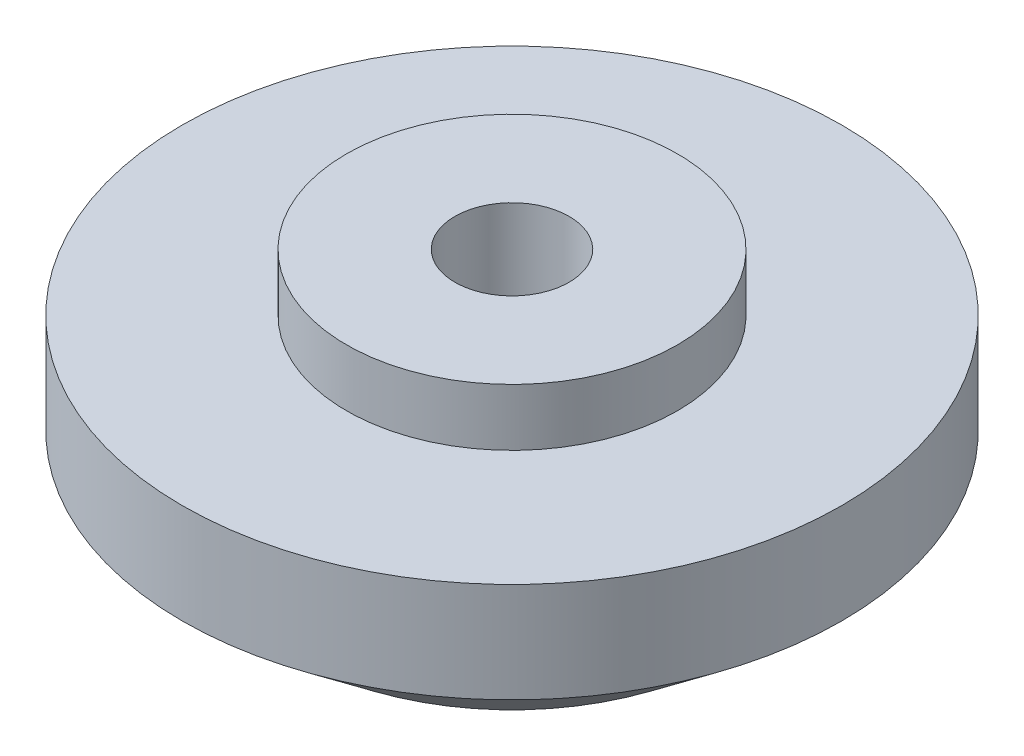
ISO-10303-21;
HEADER;
FILE_DESCRIPTION(('STEP AP214'),'2;1');
FILE_NAME('part.step','',(''),(''),'','','');
FILE_SCHEMA(('AUTOMOTIVE_DESIGN { 1 0 10303 214 1 1 1 1 }'));
ENDSEC;
DATA;
#1=APPLICATION_CONTEXT('core data for automotive mechanical design processes');
#2=APPLICATION_PROTOCOL_DEFINITION('international standard','automotive_design',2000,#1);
#3=PRODUCT_CONTEXT('',#1,'mechanical');
#4=PRODUCT('Part','Part','',(#3));
#5=PRODUCT_RELATED_PRODUCT_CATEGORY('part','',(#4));
#6=PRODUCT_DEFINITION_FORMATION('','',#4);
#7=PRODUCT_DEFINITION_CONTEXT('part definition',#1,'design');
#8=PRODUCT_DEFINITION('design','',#6,#7);
#9=PRODUCT_DEFINITION_SHAPE('','',#8);
#10=(LENGTH_UNIT() NAMED_UNIT(*) SI_UNIT(.MILLI.,.METRE.));
#11=(NAMED_UNIT(*) PLANE_ANGLE_UNIT() SI_UNIT($,.RADIAN.));
#12=(NAMED_UNIT(*) SI_UNIT($,.STERADIAN.) SOLID_ANGLE_UNIT());
#13=UNCERTAINTY_MEASURE_WITH_UNIT(LENGTH_MEASURE(1.E-05),#10,'distance_accuracy_value','');
#14=(GEOMETRIC_REPRESENTATION_CONTEXT(3) GLOBAL_UNCERTAINTY_ASSIGNED_CONTEXT((#13)) GLOBAL_UNIT_ASSIGNED_CONTEXT((#10,
#11,#12)) REPRESENTATION_CONTEXT('',''));
#15=CARTESIAN_POINT('',(0.,0.,0.));
#16=DIRECTION('',(0.,0.,1.));
#17=DIRECTION('',(1.,0.,0.));
#18=AXIS2_PLACEMENT_3D('',#15,#16,#17);
#19=CARTESIAN_POINT('',(-86.91,100.,0.));
#20=DIRECTION('',(0.,1.,0.));
#21=DIRECTION('',(-1.,0.,0.));
#22=AXIS2_PLACEMENT_3D('',#19,#20,#21);
#23=CYLINDRICAL_SURFACE('',#22,11.59);
#24=CARTESIAN_POINT('',(-86.91,66.,0.));
#25=DIRECTION('',(0.,1.,0.));
#26=DIRECTION('',(-1.,0.,0.));
#27=AXIS2_PLACEMENT_3D('',#24,#25,#26);
#28=CIRCLE('',#27,11.59);
#29=CARTESIAN_POINT('',(-98.5,66.,0.));
#30=VERTEX_POINT('',#29);
#31=EDGE_CURVE('E54',#30,#30,#28,.T.);
#32=ORIENTED_EDGE('',*,*,#31,.T.);
#33=EDGE_LOOP('',(#32));
#34=FACE_BOUND('',#33,.T.);
#35=CARTESIAN_POINT('',(-86.91,70.,0.));
#36=DIRECTION('',(0.,1.,0.));
#37=DIRECTION('',(-1.,0.,0.));
#38=AXIS2_PLACEMENT_3D('',#35,#36,#37);
#39=CIRCLE('',#38,11.59);
#40=CARTESIAN_POINT('',(-98.5,70.,0.));
#41=VERTEX_POINT('',#40);
#42=EDGE_CURVE('E10',#41,#41,#39,.T.);
#43=ORIENTED_EDGE('',*,*,#42,.F.);
#44=EDGE_LOOP('',(#43));
#45=FACE_BOUND('',#44,.T.);
#46=ADVANCED_FACE('F29',(#34,#45),#23,.T.);
#47=CARTESIAN_POINT('',(-98.5,70.,0.));
#48=DIRECTION('',(0.,1.,0.));
#49=DIRECTION('',(-1.,0.,0.));
#50=AXIS2_PLACEMENT_3D('',#47,#48,#49);
#51=PLANE('',#50);
#52=ORIENTED_EDGE('',*,*,#42,.T.);
#53=EDGE_LOOP('',(#52));
#54=FACE_BOUND('',#53,.T.);
#55=CARTESIAN_POINT('',(-86.91,70.,0.));
#56=DIRECTION('',(0.,1.,0.));
#57=DIRECTION('',(-1.,0.,0.));
#58=AXIS2_PLACEMENT_3D('',#55,#56,#57);
#59=CIRCLE('',#58,3.99999999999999);
#60=CARTESIAN_POINT('',(-90.91,70.,0.));
#61=VERTEX_POINT('',#60);
#62=EDGE_CURVE('E35',#61,#61,#59,.T.);
#63=ORIENTED_EDGE('',*,*,#62,.F.);
#64=EDGE_LOOP('',(#63));
#65=FACE_BOUND('',#64,.T.);
#66=ADVANCED_FACE('F72',(#54,#65),#51,.T.);
#67=CARTESIAN_POINT('',(-86.91,100.,0.));
#68=DIRECTION('',(0.,1.,0.));
#69=DIRECTION('',(-1.,0.,0.));
#70=AXIS2_PLACEMENT_3D('',#67,#68,#69);
#71=CYLINDRICAL_SURFACE('',#70,4.);
#72=ORIENTED_EDGE('',*,*,#62,.T.);
#73=EDGE_LOOP('',(#72));
#74=FACE_BOUND('',#73,.T.);
#75=CARTESIAN_POINT('',(-86.91,53.,0.));
#76=DIRECTION('',(0.,1.,0.));
#77=DIRECTION('',(-1.,0.,0.));
#78=AXIS2_PLACEMENT_3D('',#75,#76,#77);
#79=CIRCLE('',#78,4.00000000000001);
#80=CARTESIAN_POINT('',(-90.91,53.,0.));
#81=VERTEX_POINT('',#80);
#82=EDGE_CURVE('E39',#81,#81,#79,.T.);
#83=ORIENTED_EDGE('',*,*,#82,.F.);
#84=EDGE_LOOP('',(#83));
#85=FACE_BOUND('',#84,.T.);
#86=ADVANCED_FACE('F76',(#74,#85),#71,.F.);
#87=CARTESIAN_POINT('',(-90.91,53.,0.));
#88=DIRECTION('',(0.,-1.,0.));
#89=DIRECTION('',(1.,0.,0.));
#90=AXIS2_PLACEMENT_3D('',#87,#88,#89);
#91=PLANE('',#90);
#92=ORIENTED_EDGE('',*,*,#82,.T.);
#93=EDGE_LOOP('',(#92));
#94=FACE_BOUND('',#93,.T.);
#95=CARTESIAN_POINT('',(-86.91,53.,0.));
#96=DIRECTION('',(0.,1.,0.));
#97=DIRECTION('',(-1.,0.,0.));
#98=AXIS2_PLACEMENT_3D('',#95,#96,#97);
#99=CIRCLE('',#98,15.4639726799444);
#100=CARTESIAN_POINT('',(-102.373972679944,53.,0.));
#101=VERTEX_POINT('',#100);
#102=EDGE_CURVE('E43',#101,#101,#99,.T.);
#103=ORIENTED_EDGE('',*,*,#102,.F.);
#104=EDGE_LOOP('',(#103));
#105=FACE_BOUND('',#104,.T.);
#106=ADVANCED_FACE('F80',(#94,#105),#91,.T.);
#107=CARTESIAN_POINT('',(-86.91,59.,0.));
#108=DIRECTION('',(0.,1.,0.));
#109=DIRECTION('',(-1.,0.,0.));
#110=AXIS2_PLACEMENT_3D('',#107,#108,#109);
#111=CONICAL_SURFACE('',#110,23.09,0.904168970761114);
#112=ORIENTED_EDGE('',*,*,#102,.T.);
#113=EDGE_LOOP('',(#112));
#114=FACE_BOUND('',#113,.T.);
#115=CARTESIAN_POINT('',(-86.91,59.,0.));
#116=DIRECTION('',(0.,1.,0.));
#117=DIRECTION('',(-1.,0.,0.));
#118=AXIS2_PLACEMENT_3D('',#115,#116,#117);
#119=CIRCLE('',#118,23.09);
#120=CARTESIAN_POINT('',(-110.,59.,0.));
#121=VERTEX_POINT('',#120);
#122=EDGE_CURVE('E48',#121,#121,#119,.T.);
#123=ORIENTED_EDGE('',*,*,#122,.F.);
#124=EDGE_LOOP('',(#123));
#125=FACE_BOUND('',#124,.T.);
#126=ADVANCED_FACE('F68',(#114,#125),#111,.T.);
#127=CARTESIAN_POINT('',(-86.91,100.,0.));
#128=DIRECTION('',(0.,1.,0.));
#129=DIRECTION('',(-1.,0.,0.));
#130=AXIS2_PLACEMENT_3D('',#127,#128,#129);
#131=CYLINDRICAL_SURFACE('',#130,23.09);
#132=ORIENTED_EDGE('',*,*,#122,.T.);
#133=EDGE_LOOP('',(#132));
#134=FACE_BOUND('',#133,.T.);
#135=CARTESIAN_POINT('',(-86.91,66.,0.));
#136=DIRECTION('',(0.,1.,0.));
#137=DIRECTION('',(-1.,0.,0.));
#138=AXIS2_PLACEMENT_3D('',#135,#136,#137);
#139=CIRCLE('',#138,23.09);
#140=CARTESIAN_POINT('',(-110.,66.,0.));
#141=VERTEX_POINT('',#140);
#142=EDGE_CURVE('E51',#141,#141,#139,.T.);
#143=ORIENTED_EDGE('',*,*,#142,.F.);
#144=EDGE_LOOP('',(#143));
#145=FACE_BOUND('',#144,.T.);
#146=ADVANCED_FACE('F62',(#134,#145),#131,.T.);
#147=CARTESIAN_POINT('',(-110.,66.,0.));
#148=DIRECTION('',(0.,1.,0.));
#149=DIRECTION('',(-1.,0.,0.));
#150=AXIS2_PLACEMENT_3D('',#147,#148,#149);
#151=PLANE('',#150);
#152=ORIENTED_EDGE('',*,*,#142,.T.);
#153=EDGE_LOOP('',(#152));
#154=FACE_BOUND('',#153,.T.);
#155=ORIENTED_EDGE('',*,*,#31,.F.);
#156=EDGE_LOOP('',(#155));
#157=FACE_BOUND('',#156,.T.);
#158=ADVANCED_FACE('F60',(#154,#157),#151,.T.);
#159=CLOSED_SHELL('',(#46,#66,#86,#106,#126,#146,#158));
#160=MANIFOLD_SOLID_BREP('B2',#159);
#161=ADVANCED_BREP_SHAPE_REPRESENTATION('',(#18,#160),#14);
#162=SHAPE_DEFINITION_REPRESENTATION(#9,#161);
ENDSEC;
END-ISO-10303-21;
